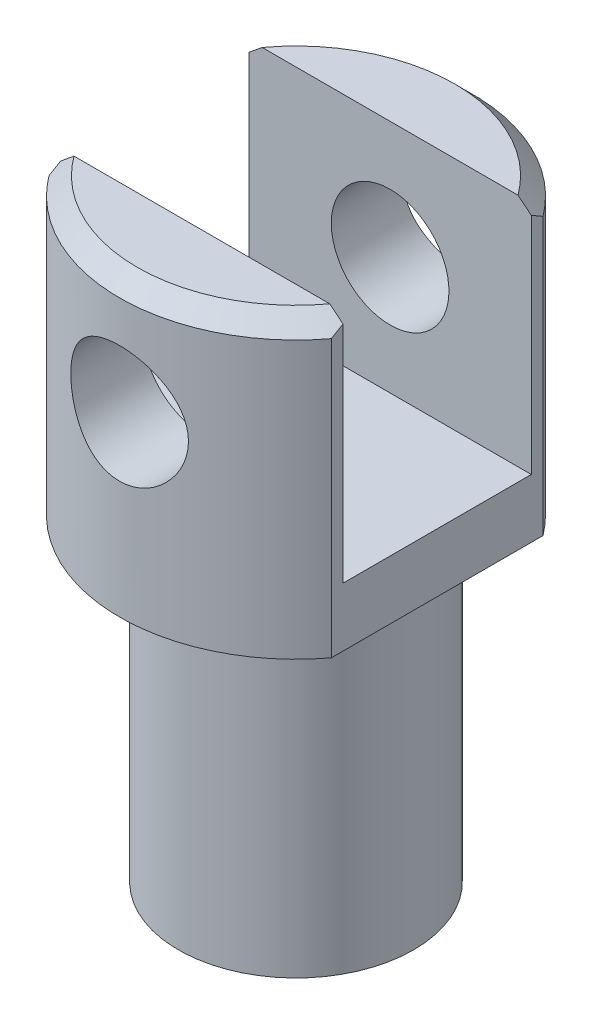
ISO-10303-21;
HEADER;
FILE_DESCRIPTION(('STEP AP214'),'2;1');
FILE_NAME('part.step','',(''),(''),'','','');
FILE_SCHEMA(('AUTOMOTIVE_DESIGN { 1 0 10303 214 1 1 1 1 }'));
ENDSEC;
DATA;
#1=APPLICATION_CONTEXT('core data for automotive mechanical design processes');
#2=APPLICATION_PROTOCOL_DEFINITION('international standard','automotive_design',2000,#1);
#3=PRODUCT_CONTEXT('',#1,'mechanical');
#4=PRODUCT('Part','Part','',(#3));
#5=PRODUCT_RELATED_PRODUCT_CATEGORY('part','',(#4));
#6=PRODUCT_DEFINITION_FORMATION('','',#4);
#7=PRODUCT_DEFINITION_CONTEXT('part definition',#1,'design');
#8=PRODUCT_DEFINITION('design','',#6,#7);
#9=PRODUCT_DEFINITION_SHAPE('','',#8);
#10=(LENGTH_UNIT() NAMED_UNIT(*) SI_UNIT(.MILLI.,.METRE.));
#11=(NAMED_UNIT(*) PLANE_ANGLE_UNIT() SI_UNIT($,.RADIAN.));
#12=(NAMED_UNIT(*) SI_UNIT($,.STERADIAN.) SOLID_ANGLE_UNIT());
#13=UNCERTAINTY_MEASURE_WITH_UNIT(LENGTH_MEASURE(1.E-05),#10,'distance_accuracy_value','');
#14=(GEOMETRIC_REPRESENTATION_CONTEXT(3) GLOBAL_UNCERTAINTY_ASSIGNED_CONTEXT((#13)) GLOBAL_UNIT_ASSIGNED_CONTEXT((#10,
#11,#12)) REPRESENTATION_CONTEXT('',''));
#15=CARTESIAN_POINT('',(0.,0.,0.));
#16=DIRECTION('',(0.,0.,1.));
#17=DIRECTION('',(1.,0.,0.));
#18=AXIS2_PLACEMENT_3D('',#15,#16,#17);
#19=CARTESIAN_POINT('',(0.,24.5,0.));
#20=DIRECTION('',(0.,-1.,0.));
#21=DIRECTION('',(1.,0.,0.));
#22=AXIS2_PLACEMENT_3D('',#19,#20,#21);
#23=CONICAL_SURFACE('',#22,15.,0.785398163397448);
#24=CARTESIAN_POINT('',(-12.,20.0499792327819,15.306969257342));
#25=CARTESIAN_POINT('',(-12.,20.2711295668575,15.0259350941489));
#26=CARTESIAN_POINT('',(-12.,20.4908772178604,14.7437881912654));
#27=CARTESIAN_POINT('',(-12.,20.9270976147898,14.1769416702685));
#28=CARTESIAN_POINT('',(-12.,21.1435701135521,13.8922418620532));
#29=CARTESIAN_POINT('',(-12.,21.5729780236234,13.3196834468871));
#30=CARTESIAN_POINT('',(-12.,21.785909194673,13.0318216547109));
#31=CARTESIAN_POINT('',(-12.,22.2073656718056,12.4528954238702));
#32=CARTESIAN_POINT('',(-12.,22.4158910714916,12.1618310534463));
#33=CARTESIAN_POINT('',(-12.,22.8250138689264,11.5800413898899));
#34=CARTESIAN_POINT('',(-12.,23.0256803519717,11.289364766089));
#35=CARTESIAN_POINT('',(-12.,23.4211336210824,10.7040415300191));
#36=CARTESIAN_POINT('',(-12.,23.6159205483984,10.4093950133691));
#37=CARTESIAN_POINT('',(-12.,23.9985332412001,9.81565161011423));
#38=CARTESIAN_POINT('',(-12.,24.1863598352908,9.51655525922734));
#39=CARTESIAN_POINT('',(-12.,24.5537465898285,8.91334325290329));
#40=CARTESIAN_POINT('',(-12.,24.7333071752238,8.60922785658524));
#41=CARTESIAN_POINT('',(-12.,25.1438065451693,7.88775435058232));
#42=CARTESIAN_POINT('',(-12.,25.3706938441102,7.46806596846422));
#43=CARTESIAN_POINT('',(-12.,25.8013110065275,6.61729217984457));
#44=CARTESIAN_POINT('',(-12.,26.00505824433,6.18621562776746));
#45=CARTESIAN_POINT('',(-12.,26.3848011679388,5.30724306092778));
#46=CARTESIAN_POINT('',(-12.,26.5605376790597,4.85923265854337));
#47=CARTESIAN_POINT('',(-12.,26.8741768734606,3.94893510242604));
#48=CARTESIAN_POINT('',(-12.,27.0119773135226,3.48661303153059));
#49=CARTESIAN_POINT('',(-12.,27.1263544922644,3.01779773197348));
#50=B_SPLINE_CURVE_WITH_KNOTS('',3,(#24,#25,#26,#27,#28,#29,#30,#31,#32,#33,#34,#35,#36,#37,#38,
#39,#40,#41,#42,#43,#44,#45,#46,#47,#48,#49),.UNSPECIFIED.,.F.,.F.,(4,2,2,2,2,2,2,2,2,2,2,2,4),
(0.,1.07284754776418,2.1457756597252,3.21990736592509,4.29401622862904,5.3535960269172,
6.41315034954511,7.47257812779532,8.53195138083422,9.96264180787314,11.3922508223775,
12.8344031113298,14.2804049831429),.UNSPECIFIED.);
#51=CARTESIAN_POINT('',(-12.,24.5,9.00000000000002));
#52=VERTEX_POINT('',#51);
#53=CARTESIAN_POINT('',(-12.,25.077794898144,8.));
#54=VERTEX_POINT('',#53);
#55=EDGE_CURVE('E166',#52,#54,#50,.T.);
#56=ORIENTED_EDGE('',*,*,#55,.F.);
#57=CARTESIAN_POINT('',(0.,24.5,0.));
#58=DIRECTION('',(0.,1.,0.));
#59=DIRECTION('',(-1.,0.,0.));
#60=AXIS2_PLACEMENT_3D('',#57,#58,#59);
#61=CIRCLE('',#60,15.);
#62=CARTESIAN_POINT('',(12.,24.5,9.00000000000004));
#63=VERTEX_POINT('',#62);
#64=EDGE_CURVE('E261',#52,#63,#61,.T.);
#65=ORIENTED_EDGE('',*,*,#64,.T.);
#66=CARTESIAN_POINT('',(12.,27.1263544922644,3.01779773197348));
#67=CARTESIAN_POINT('',(12.,27.0119773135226,3.48661303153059));
#68=CARTESIAN_POINT('',(12.,26.8741768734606,3.94893510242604));
#69=CARTESIAN_POINT('',(12.,26.5605376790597,4.85923265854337));
#70=CARTESIAN_POINT('',(12.,26.3848011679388,5.30724306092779));
#71=CARTESIAN_POINT('',(12.,26.00505824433,6.18621562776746));
#72=CARTESIAN_POINT('',(12.,25.8013110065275,6.61729217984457));
#73=CARTESIAN_POINT('',(12.,25.3706938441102,7.46806596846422));
#74=CARTESIAN_POINT('',(12.,25.1438065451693,7.88775435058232));
#75=CARTESIAN_POINT('',(12.,24.7333071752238,8.60922785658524));
#76=CARTESIAN_POINT('',(12.,24.5537465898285,8.9133432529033));
#77=CARTESIAN_POINT('',(12.,24.1863598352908,9.51655525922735));
#78=CARTESIAN_POINT('',(12.,23.9985332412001,9.81565161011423));
#79=CARTESIAN_POINT('',(12.,23.6159205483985,10.4093950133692));
#80=CARTESIAN_POINT('',(12.,23.4211336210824,10.7040415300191));
#81=CARTESIAN_POINT('',(12.,23.0256803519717,11.289364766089));
#82=CARTESIAN_POINT('',(12.,22.8250138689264,11.5800413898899));
#83=CARTESIAN_POINT('',(12.,22.4158910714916,12.1618310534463));
#84=CARTESIAN_POINT('',(12.,22.2073656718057,12.4528954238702));
#85=CARTESIAN_POINT('',(12.,21.785909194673,13.0318216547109));
#86=CARTESIAN_POINT('',(12.,21.5729780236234,13.3196834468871));
#87=CARTESIAN_POINT('',(12.,21.1435701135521,13.8922418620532));
#88=CARTESIAN_POINT('',(12.,20.9270976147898,14.1769416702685));
#89=CARTESIAN_POINT('',(12.,20.4908772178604,14.7437881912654));
#90=CARTESIAN_POINT('',(12.,20.2711295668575,15.0259350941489));
#91=CARTESIAN_POINT('',(12.,20.0499792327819,15.306969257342));
#92=B_SPLINE_CURVE_WITH_KNOTS('',3,(#66,#67,#68,#69,#70,#71,#72,#73,#74,#75,#76,#77,#78,#79,#80,
#81,#82,#83,#84,#85,#86,#87,#88,#89,#90,#91),.UNSPECIFIED.,.F.,.F.,(4,2,2,2,2,2,2,2,2,2,2,2,4),
(0.,1.44600187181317,2.88815416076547,4.31776317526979,5.74845360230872,6.80782685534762,
7.86725463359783,8.92680895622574,9.9863887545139,11.0604976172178,12.1346293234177,
13.2075574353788,14.2804049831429),.UNSPECIFIED.);
#93=CARTESIAN_POINT('',(12.,25.077794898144,8.));
#94=VERTEX_POINT('',#93);
#95=EDGE_CURVE('E215',#94,#63,#92,.T.);
#96=ORIENTED_EDGE('',*,*,#95,.F.);
#97=CARTESIAN_POINT('',(21.9010917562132,16.1835289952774,8.));
#98=CARTESIAN_POINT('',(21.4322837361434,16.623843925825,8.));
#99=CARTESIAN_POINT('',(20.9626766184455,17.0633122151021,8.));
#100=CARTESIAN_POINT('',(20.0214501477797,17.9401123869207,8.));
#101=CARTESIAN_POINT('',(19.5498307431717,18.3774442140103,8.));
#102=CARTESIAN_POINT('',(18.6039593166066,19.2497181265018,8.));
#103=CARTESIAN_POINT('',(18.1297061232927,19.6846589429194,8.));
#104=CARTESIAN_POINT('',(17.1782467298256,20.5512915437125,8.));
#105=CARTESIAN_POINT('',(16.7010405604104,20.9829833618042,8.));
#106=CARTESIAN_POINT('',(15.7462499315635,21.8393072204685,8.));
#107=CARTESIAN_POINT('',(15.2686907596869,22.2639674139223,8.));
#108=CARTESIAN_POINT('',(14.308993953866,23.1080764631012,8.));
#109=CARTESIAN_POINT('',(13.8268563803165,23.5275253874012,8.));
#110=CARTESIAN_POINT('',(12.8566638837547,24.3596114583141,8.));
#111=CARTESIAN_POINT('',(12.3686086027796,24.7722481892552,8.));
#112=CARTESIAN_POINT('',(11.6307432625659,25.3842129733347,8.));
#113=CARTESIAN_POINT('',(11.3838285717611,25.5870328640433,8.));
#114=CARTESIAN_POINT('',(10.8877620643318,25.9899157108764,8.));
#115=CARTESIAN_POINT('',(10.6386102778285,26.1899787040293,8.));
#116=CARTESIAN_POINT('',(10.1555457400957,26.5727042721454,8.));
#117=CARTESIAN_POINT('',(9.92181114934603,26.7555914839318,8.));
#118=CARTESIAN_POINT('',(9.45176517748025,27.1180188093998,8.));
#119=CARTESIAN_POINT('',(9.21545385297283,27.297558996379,8.));
#120=CARTESIAN_POINT('',(8.7399958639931,27.6525309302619,8.));
#121=CARTESIAN_POINT('',(8.50085111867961,27.8279652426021,8.));
#122=CARTESIAN_POINT('',(8.01910626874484,28.1740132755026,8.));
#123=CARTESIAN_POINT('',(7.77650631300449,28.344627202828,8.));
#124=CARTESIAN_POINT('',(7.28641570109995,28.6805777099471,8.));
#125=CARTESIAN_POINT('',(7.03891089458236,28.8458937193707,8.));
#126=CARTESIAN_POINT('',(6.53922204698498,29.1692142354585,8.));
#127=CARTESIAN_POINT('',(6.28703889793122,29.3272201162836,8.));
#128=CARTESIAN_POINT('',(5.77661874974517,29.6345205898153,8.));
#129=CARTESIAN_POINT('',(5.51836965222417,29.7837952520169,8.));
#130=CARTESIAN_POINT('',(5.12619639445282,29.9991596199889,8.));
#131=CARTESIAN_POINT('',(4.99462741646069,30.069545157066,8.));
#132=CARTESIAN_POINT('',(4.72979361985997,30.207090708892,8.));
#133=CARTESIAN_POINT('',(4.59652857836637,30.2742502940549,8.));
#134=CARTESIAN_POINT('',(4.46237149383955,30.3396092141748,8.));
#135=B_SPLINE_CURVE_WITH_KNOTS('',3,(#97,#98,#99,#100,#101,#102,#103,#104,#105,#106,#107,#108,
#109,#110,#111,#112,#113,#114,#115,#116,#117,#118,#119,#120,#121,#122,#123,#124,#125,#126,#127,
#128,#129,#130,#131,#132,#133,#134),.UNSPECIFIED.,.F.,.F.,(4,2,2,2,2,2,2,2,2,2,2,2,2,2,2,2,2,2,
4),(0.,1.92949116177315,3.85903214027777,5.78951380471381,7.71997540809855,9.63712859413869,
11.5542565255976,13.4715010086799,14.4300913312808,15.3886687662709,16.2789898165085,
17.1692913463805,18.0590208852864,18.948712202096,19.8415187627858,20.7341568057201,
21.6287587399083,22.0763579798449,22.5240166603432),.UNSPECIFIED.);
#136=CARTESIAN_POINT('',(10.8742815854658,26.,8.));
#137=VERTEX_POINT('',#136);
#138=EDGE_CURVE('E195',#94,#137,#135,.T.);
#139=ORIENTED_EDGE('',*,*,#138,.T.);
#140=CARTESIAN_POINT('',(0.,26.,0.));
#141=DIRECTION('',(0.,1.,0.));
#142=DIRECTION('',(-1.,0.,0.));
#143=AXIS2_PLACEMENT_3D('',#140,#141,#142);
#144=CIRCLE('',#143,13.5);
#145=CARTESIAN_POINT('',(-10.8742815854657,26.,8.));
#146=VERTEX_POINT('',#145);
#147=EDGE_CURVE('E264',#146,#137,#144,.T.);
#148=ORIENTED_EDGE('',*,*,#147,.F.);
#149=CARTESIAN_POINT('',(-4.46237149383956,30.3396092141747,8.));
#150=CARTESIAN_POINT('',(-4.59652857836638,30.2742502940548,8.));
#151=CARTESIAN_POINT('',(-4.72979361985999,30.207090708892,8.));
#152=CARTESIAN_POINT('',(-4.99462741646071,30.0695451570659,8.));
#153=CARTESIAN_POINT('',(-5.12619639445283,29.9991596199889,8.));
#154=CARTESIAN_POINT('',(-5.51836965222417,29.7837952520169,8.));
#155=CARTESIAN_POINT('',(-5.77661874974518,29.6345205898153,8.));
#156=CARTESIAN_POINT('',(-6.28703889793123,29.3272201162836,8.));
#157=CARTESIAN_POINT('',(-6.53922204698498,29.1692142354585,8.));
#158=CARTESIAN_POINT('',(-7.03891089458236,28.8458937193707,8.));
#159=CARTESIAN_POINT('',(-7.28641570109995,28.6805777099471,8.));
#160=CARTESIAN_POINT('',(-7.77650631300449,28.344627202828,8.));
#161=CARTESIAN_POINT('',(-8.01910626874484,28.1740132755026,8.));
#162=CARTESIAN_POINT('',(-8.5008511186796,27.8279652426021,8.));
#163=CARTESIAN_POINT('',(-8.73999586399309,27.6525309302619,8.));
#164=CARTESIAN_POINT('',(-9.21545385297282,27.297558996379,8.));
#165=CARTESIAN_POINT('',(-9.45176517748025,27.1180188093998,8.));
#166=CARTESIAN_POINT('',(-9.92181114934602,26.7555914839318,8.));
#167=CARTESIAN_POINT('',(-10.1555457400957,26.5727042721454,8.));
#168=CARTESIAN_POINT('',(-10.6386102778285,26.1899787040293,8.));
#169=CARTESIAN_POINT('',(-10.8877620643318,25.9899157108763,8.));
#170=CARTESIAN_POINT('',(-11.3838285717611,25.5870328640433,8.));
#171=CARTESIAN_POINT('',(-11.6307432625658,25.3842129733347,8.));
#172=CARTESIAN_POINT('',(-12.3686086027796,24.7722481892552,8.));
#173=CARTESIAN_POINT('',(-12.8566638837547,24.359611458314,8.));
#174=CARTESIAN_POINT('',(-13.8268563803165,23.5275253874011,8.));
#175=CARTESIAN_POINT('',(-14.308993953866,23.1080764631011,8.));
#176=CARTESIAN_POINT('',(-15.2686907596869,22.2639674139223,8.));
#177=CARTESIAN_POINT('',(-15.7462499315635,21.8393072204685,8.));
#178=CARTESIAN_POINT('',(-16.7010405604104,20.9829833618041,8.));
#179=CARTESIAN_POINT('',(-17.1782467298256,20.5512915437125,8.));
#180=CARTESIAN_POINT('',(-18.1297061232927,19.6846589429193,8.));
#181=CARTESIAN_POINT('',(-18.6039593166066,19.2497181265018,8.));
#182=CARTESIAN_POINT('',(-19.5498307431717,18.3774442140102,8.));
#183=CARTESIAN_POINT('',(-20.0214501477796,17.9401123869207,8.));
#184=CARTESIAN_POINT('',(-20.9626766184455,17.0633122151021,8.));
#185=CARTESIAN_POINT('',(-21.4322837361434,16.623843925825,8.));
#186=CARTESIAN_POINT('',(-21.9010917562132,16.1835289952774,8.));
#187=B_SPLINE_CURVE_WITH_KNOTS('',3,(#149,#150,#151,#152,#153,#154,#155,#156,#157,#158,#159,
#160,#161,#162,#163,#164,#165,#166,#167,#168,#169,#170,#171,#172,#173,#174,#175,#176,#177,#178,
#179,#180,#181,#182,#183,#184,#185,#186),.UNSPECIFIED.,.F.,.F.,(4,2,2,2,2,2,2,2,2,2,2,2,2,2,2,2,
2,2,4),(0.,0.447658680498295,0.895257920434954,1.78985985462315,2.6824978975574,
3.57530445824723,4.4649957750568,5.35472531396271,6.24502684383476,7.13534789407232,
8.09392532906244,9.05251565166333,10.9697601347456,12.8868880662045,14.8040412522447,
16.7345028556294,18.6649845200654,20.5945254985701,22.5240166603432),.UNSPECIFIED.);
#188=EDGE_CURVE('E202',#146,#54,#187,.T.);
#189=ORIENTED_EDGE('',*,*,#188,.T.);
#190=EDGE_LOOP('',(#56,#65,#96,#139,#148,#189));
#191=FACE_BOUND('',#190,.T.);
#192=ADVANCED_FACE('F33',(#191),#23,.T.);
#193=CARTESIAN_POINT('',(-12.,27.061932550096,-3.27192938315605));
#194=CARTESIAN_POINT('',(-12.,26.9944285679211,-3.52856686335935));
#195=CARTESIAN_POINT('',(-12.,26.9200222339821,-3.78329177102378));
#196=CARTESIAN_POINT('',(-12.,26.7589081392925,-4.28867001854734));
#197=CARTESIAN_POINT('',(-12.,26.672207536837,-4.53932563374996));
#198=CARTESIAN_POINT('',(-12.,26.3963374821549,-5.28377409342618));
#199=CARTESIAN_POINT('',(-12.,26.1909783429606,-5.7715848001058));
#200=CARTESIAN_POINT('',(-12.,25.7492549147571,-6.72765465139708));
#201=CARTESIAN_POINT('',(-12.,25.5131656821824,-7.19604364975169));
#202=CARTESIAN_POINT('',(-12.,25.0161845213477,-8.119892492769));
#203=CARTESIAN_POINT('',(-12.,24.7552714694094,-8.57534088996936));
#204=CARTESIAN_POINT('',(-12.,24.3030275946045,-9.32771611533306));
#205=CARTESIAN_POINT('',(-12.,24.1168461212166,-9.62777393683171));
#206=CARTESIAN_POINT('',(-12.,23.7372791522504,-10.2233094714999));
#207=CARTESIAN_POINT('',(-12.,23.5438934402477,-10.5187870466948));
#208=CARTESIAN_POINT('',(-12.,23.1510609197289,-11.1056429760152));
#209=CARTESIAN_POINT('',(-12.,22.9516145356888,-11.3970216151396));
#210=CARTESIAN_POINT('',(-12.,22.5475477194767,-11.9761709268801));
#211=CARTESIAN_POINT('',(-12.,22.3429271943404,-12.2639415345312));
#212=CARTESIAN_POINT('',(-12.,21.9267957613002,-12.8396866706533));
#213=CARTESIAN_POINT('',(-12.,21.7152318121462,-13.1276228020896));
#214=CARTESIAN_POINT('',(-12.,21.2881998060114,-13.7005887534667));
#215=CARTESIAN_POINT('',(-12.,21.072731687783,-13.9856185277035));
#216=CARTESIAN_POINT('',(-12.,20.6385711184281,-14.552898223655));
#217=CARTESIAN_POINT('',(-12.,20.4198809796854,-14.8351499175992));
#218=CARTESIAN_POINT('',(-12.,19.9795649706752,-15.3973288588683));
#219=CARTESIAN_POINT('',(-12.,19.7579392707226,-15.6772562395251));
#220=CARTESIAN_POINT('',(-12.,19.5350495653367,-15.9561663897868));
#221=B_SPLINE_CURVE_WITH_KNOTS('',3,(#193,#194,#195,#196,#197,#198,#199,#200,#201,#202,#203,
#204,#205,#206,#207,#208,#209,#210,#211,#212,#213,#214,#215,#216,#217,#218,#219,#220),
.UNSPECIFIED.,.F.,.F.,(4,2,2,2,2,2,2,2,2,2,2,2,2,4),(0.,0.795857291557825,1.59125308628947,
3.17728405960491,4.74998670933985,6.32403981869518,7.38332201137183,8.44263605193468,
9.5018760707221,10.5611351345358,11.6330109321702,12.7049035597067,13.776061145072,
14.8471568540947),.UNSPECIFIED.);
#222=CARTESIAN_POINT('',(-12.,25.077794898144,-7.99999999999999));
#223=VERTEX_POINT('',#222);
#224=CARTESIAN_POINT('',(-12.,24.5,-8.99999999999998));
#225=VERTEX_POINT('',#224);
#226=EDGE_CURVE('E160',#223,#225,#221,.T.);
#227=ORIENTED_EDGE('',*,*,#226,.F.);
#228=CARTESIAN_POINT('',(-21.9010917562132,16.1835289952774,-7.99999999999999));
#229=CARTESIAN_POINT('',(-21.4322837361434,16.623843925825,-7.99999999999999));
#230=CARTESIAN_POINT('',(-20.9626766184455,17.0633122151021,-7.99999999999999));
#231=CARTESIAN_POINT('',(-20.0214501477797,17.9401123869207,-7.99999999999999));
#232=CARTESIAN_POINT('',(-19.5498307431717,18.3774442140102,-7.99999999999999));
#233=CARTESIAN_POINT('',(-18.6039593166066,19.2497181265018,-7.99999999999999));
#234=CARTESIAN_POINT('',(-18.1297061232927,19.6846589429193,-7.99999999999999));
#235=CARTESIAN_POINT('',(-17.1782467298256,20.5512915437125,-7.99999999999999));
#236=CARTESIAN_POINT('',(-16.7010405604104,20.9829833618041,-7.99999999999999));
#237=CARTESIAN_POINT('',(-15.7462499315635,21.8393072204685,-7.99999999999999));
#238=CARTESIAN_POINT('',(-15.2686907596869,22.2639674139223,-7.99999999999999));
#239=CARTESIAN_POINT('',(-14.308993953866,23.1080764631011,-7.99999999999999));
#240=CARTESIAN_POINT('',(-13.8268563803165,23.5275253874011,-7.99999999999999));
#241=CARTESIAN_POINT('',(-12.8566638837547,24.359611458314,-7.99999999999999));
#242=CARTESIAN_POINT('',(-12.3686086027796,24.7722481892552,-7.99999999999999));
#243=CARTESIAN_POINT('',(-11.6307432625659,25.3842129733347,-7.99999999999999));
#244=CARTESIAN_POINT('',(-11.3838285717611,25.5870328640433,-7.99999999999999));
#245=CARTESIAN_POINT('',(-10.8877620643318,25.9899157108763,-7.99999999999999));
#246=CARTESIAN_POINT('',(-10.6386102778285,26.1899787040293,-7.99999999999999));
#247=CARTESIAN_POINT('',(-10.1555457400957,26.5727042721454,-7.99999999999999));
#248=CARTESIAN_POINT('',(-9.92181114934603,26.7555914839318,-7.99999999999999));
#249=CARTESIAN_POINT('',(-9.45176517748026,27.1180188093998,-7.99999999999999));
#250=CARTESIAN_POINT('',(-9.21545385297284,27.297558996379,-7.99999999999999));
#251=CARTESIAN_POINT('',(-8.73999586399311,27.6525309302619,-7.99999999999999));
#252=CARTESIAN_POINT('',(-8.50085111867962,27.8279652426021,-7.99999999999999));
#253=CARTESIAN_POINT('',(-8.01910626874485,28.1740132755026,-7.99999999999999));
#254=CARTESIAN_POINT('',(-7.7765063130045,28.344627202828,-7.99999999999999));
#255=CARTESIAN_POINT('',(-7.28641570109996,28.6805777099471,-7.99999999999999));
#256=CARTESIAN_POINT('',(-7.03891089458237,28.8458937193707,-7.99999999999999));
#257=CARTESIAN_POINT('',(-6.53922204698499,29.1692142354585,-7.99999999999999));
#258=CARTESIAN_POINT('',(-6.28703889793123,29.3272201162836,-7.99999999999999));
#259=CARTESIAN_POINT('',(-5.77661874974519,29.6345205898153,-7.99999999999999));
#260=CARTESIAN_POINT('',(-5.51836965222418,29.7837952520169,-7.99999999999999));
#261=CARTESIAN_POINT('',(-5.12619639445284,29.9991596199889,-7.99999999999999));
#262=CARTESIAN_POINT('',(-4.99462741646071,30.0695451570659,-7.99999999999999));
#263=CARTESIAN_POINT('',(-4.72979361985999,30.207090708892,-7.99999999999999));
#264=CARTESIAN_POINT('',(-4.59652857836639,30.2742502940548,-7.99999999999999));
#265=CARTESIAN_POINT('',(-4.46237149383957,30.3396092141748,-7.99999999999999));
#266=B_SPLINE_CURVE_WITH_KNOTS('',3,(#228,#229,#230,#231,#232,#233,#234,#235,#236,#237,#238,
#239,#240,#241,#242,#243,#244,#245,#246,#247,#248,#249,#250,#251,#252,#253,#254,#255,#256,#257,
#258,#259,#260,#261,#262,#263,#264,#265),.UNSPECIFIED.,.F.,.F.,(4,2,2,2,2,2,2,2,2,2,2,2,2,2,2,2,
2,2,4),(0.,1.92949116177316,3.85903214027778,5.78951380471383,7.71997540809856,9.63712859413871,
11.5542565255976,13.4715010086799,14.4300913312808,15.3886687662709,16.2789898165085,
17.1692913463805,18.0590208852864,18.948712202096,19.8415187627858,20.7341568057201,
21.6287587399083,22.0763579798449,22.5240166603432),.UNSPECIFIED.);
#267=CARTESIAN_POINT('',(-10.8742815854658,26.,-7.99999999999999));
#268=VERTEX_POINT('',#267);
#269=EDGE_CURVE('E189',#223,#268,#266,.T.);
#270=ORIENTED_EDGE('',*,*,#269,.T.);
#271=CARTESIAN_POINT('',(10.8742815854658,26.,-7.99999999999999));
#272=VERTEX_POINT('',#271);
#273=EDGE_CURVE('E263',#272,#268,#144,.T.);
#274=ORIENTED_EDGE('',*,*,#273,.F.);
#275=CARTESIAN_POINT('',(4.46237149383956,30.3396092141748,-7.99999999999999));
#276=CARTESIAN_POINT('',(4.59652857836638,30.2742502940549,-7.99999999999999));
#277=CARTESIAN_POINT('',(4.72979361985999,30.207090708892,-7.99999999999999));
#278=CARTESIAN_POINT('',(4.99462741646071,30.069545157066,-7.99999999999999));
#279=CARTESIAN_POINT('',(5.12619639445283,29.9991596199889,-7.99999999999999));
#280=CARTESIAN_POINT('',(5.51836965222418,29.7837952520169,-7.99999999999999));
#281=CARTESIAN_POINT('',(5.77661874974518,29.6345205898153,-7.99999999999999));
#282=CARTESIAN_POINT('',(6.28703889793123,29.3272201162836,-7.99999999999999));
#283=CARTESIAN_POINT('',(6.53922204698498,29.1692142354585,-7.99999999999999));
#284=CARTESIAN_POINT('',(7.03891089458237,28.8458937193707,-7.99999999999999));
#285=CARTESIAN_POINT('',(7.28641570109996,28.6805777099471,-7.99999999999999));
#286=CARTESIAN_POINT('',(7.7765063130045,28.344627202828,-7.99999999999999));
#287=CARTESIAN_POINT('',(8.01910626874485,28.1740132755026,-7.99999999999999));
#288=CARTESIAN_POINT('',(8.50085111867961,27.8279652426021,-7.99999999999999));
#289=CARTESIAN_POINT('',(8.7399958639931,27.6525309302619,-7.99999999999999));
#290=CARTESIAN_POINT('',(9.21545385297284,27.297558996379,-7.99999999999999));
#291=CARTESIAN_POINT('',(9.45176517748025,27.1180188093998,-7.99999999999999));
#292=CARTESIAN_POINT('',(9.92181114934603,26.7555914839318,-7.99999999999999));
#293=CARTESIAN_POINT('',(10.1555457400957,26.5727042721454,-7.99999999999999));
#294=CARTESIAN_POINT('',(10.6386102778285,26.1899787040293,-7.99999999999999));
#295=CARTESIAN_POINT('',(10.8877620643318,25.9899157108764,-7.99999999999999));
#296=CARTESIAN_POINT('',(11.3838285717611,25.5870328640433,-7.99999999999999));
#297=CARTESIAN_POINT('',(11.6307432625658,25.3842129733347,-7.99999999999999));
#298=CARTESIAN_POINT('',(12.3686086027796,24.7722481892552,-7.99999999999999));
#299=CARTESIAN_POINT('',(12.8566638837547,24.3596114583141,-7.99999999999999));
#300=CARTESIAN_POINT('',(13.8268563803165,23.5275253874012,-7.99999999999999));
#301=CARTESIAN_POINT('',(14.308993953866,23.1080764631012,-7.99999999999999));
#302=CARTESIAN_POINT('',(15.2686907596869,22.2639674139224,-7.99999999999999));
#303=CARTESIAN_POINT('',(15.7462499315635,21.8393072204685,-7.99999999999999));
#304=CARTESIAN_POINT('',(16.7010405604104,20.9829833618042,-7.99999999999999));
#305=CARTESIAN_POINT('',(17.1782467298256,20.5512915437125,-7.99999999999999));
#306=CARTESIAN_POINT('',(18.1297061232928,19.6846589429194,-7.99999999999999));
#307=CARTESIAN_POINT('',(18.6039593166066,19.2497181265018,-7.99999999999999));
#308=CARTESIAN_POINT('',(19.5498307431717,18.3774442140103,-7.99999999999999));
#309=CARTESIAN_POINT('',(20.0214501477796,17.9401123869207,-7.99999999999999));
#310=CARTESIAN_POINT('',(20.9626766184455,17.0633122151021,-7.99999999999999));
#311=CARTESIAN_POINT('',(21.4322837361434,16.623843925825,-7.99999999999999));
#312=CARTESIAN_POINT('',(21.9010917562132,16.1835289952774,-7.99999999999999));
#313=B_SPLINE_CURVE_WITH_KNOTS('',3,(#275,#276,#277,#278,#279,#280,#281,#282,#283,#284,#285,
#286,#287,#288,#289,#290,#291,#292,#293,#294,#295,#296,#297,#298,#299,#300,#301,#302,#303,#304,
#305,#306,#307,#308,#309,#310,#311,#312),.UNSPECIFIED.,.F.,.F.,(4,2,2,2,2,2,2,2,2,2,2,2,2,2,2,2,
2,2,4),(0.,0.447658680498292,0.895257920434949,1.78985985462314,2.68249789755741,
3.57530445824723,4.46499577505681,5.35472531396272,6.24502684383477,7.13534789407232,
8.09392532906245,9.05251565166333,10.9697601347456,12.8868880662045,14.8040412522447,
16.7345028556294,18.6649845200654,20.5945254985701,22.5240166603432),.UNSPECIFIED.);
#314=CARTESIAN_POINT('',(12.,25.077794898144,-7.99999999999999));
#315=VERTEX_POINT('',#314);
#316=EDGE_CURVE('E180',#272,#315,#313,.T.);
#317=ORIENTED_EDGE('',*,*,#316,.T.);
#318=CARTESIAN_POINT('',(12.,19.5350495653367,-15.9561663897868));
#319=CARTESIAN_POINT('',(12.,19.7579392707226,-15.6772562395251));
#320=CARTESIAN_POINT('',(12.,19.9795649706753,-15.3973288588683));
#321=CARTESIAN_POINT('',(12.,20.4198809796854,-14.8351499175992));
#322=CARTESIAN_POINT('',(12.,20.6385711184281,-14.552898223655));
#323=CARTESIAN_POINT('',(12.,21.0727316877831,-13.9856185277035));
#324=CARTESIAN_POINT('',(12.,21.2881998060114,-13.7005887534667));
#325=CARTESIAN_POINT('',(12.,21.7152318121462,-13.1276228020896));
#326=CARTESIAN_POINT('',(12.,21.9267957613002,-12.8396866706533));
#327=CARTESIAN_POINT('',(12.,22.3429271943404,-12.2639415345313));
#328=CARTESIAN_POINT('',(12.,22.5475477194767,-11.9761709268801));
#329=CARTESIAN_POINT('',(12.,22.9516145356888,-11.3970216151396));
#330=CARTESIAN_POINT('',(12.,23.1510609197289,-11.1056429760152));
#331=CARTESIAN_POINT('',(12.,23.5438934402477,-10.5187870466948));
#332=CARTESIAN_POINT('',(12.,23.7372791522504,-10.2233094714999));
#333=CARTESIAN_POINT('',(12.,24.1168461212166,-9.62777393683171));
#334=CARTESIAN_POINT('',(12.,24.3030275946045,-9.32771611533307));
#335=CARTESIAN_POINT('',(12.,24.7552714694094,-8.57534088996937));
#336=CARTESIAN_POINT('',(12.,25.0161845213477,-8.11989249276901));
#337=CARTESIAN_POINT('',(12.,25.5131656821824,-7.1960436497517));
#338=CARTESIAN_POINT('',(12.,25.7492549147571,-6.72765465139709));
#339=CARTESIAN_POINT('',(12.,26.1909783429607,-5.7715848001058));
#340=CARTESIAN_POINT('',(12.,26.3963374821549,-5.28377409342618));
#341=CARTESIAN_POINT('',(12.,26.672207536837,-4.53932563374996));
#342=CARTESIAN_POINT('',(12.,26.7589081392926,-4.28867001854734));
#343=CARTESIAN_POINT('',(12.,26.9200222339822,-3.78329177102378));
#344=CARTESIAN_POINT('',(12.,26.9944285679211,-3.52856686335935));
#345=CARTESIAN_POINT('',(12.,27.0619325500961,-3.27192938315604));
#346=B_SPLINE_CURVE_WITH_KNOTS('',3,(#318,#319,#320,#321,#322,#323,#324,#325,#326,#327,#328,
#329,#330,#331,#332,#333,#334,#335,#336,#337,#338,#339,#340,#341,#342,#343,#344,#345),
.UNSPECIFIED.,.F.,.F.,(4,2,2,2,2,2,2,2,2,2,2,2,2,4),(0.,1.07109570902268,2.14225329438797,
3.21414592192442,4.28602171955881,5.34528078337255,6.40452080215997,7.46383484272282,
8.52311703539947,10.0971701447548,11.6698727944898,13.2559037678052,14.0512995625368,
14.8471568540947),.UNSPECIFIED.);
#347=CARTESIAN_POINT('',(12.,24.5,-9.));
#348=VERTEX_POINT('',#347);
#349=EDGE_CURVE('E209',#348,#315,#346,.T.);
#350=ORIENTED_EDGE('',*,*,#349,.F.);
#351=EDGE_CURVE('E260',#348,#225,#61,.T.);
#352=ORIENTED_EDGE('',*,*,#351,.T.);
#353=EDGE_LOOP('',(#227,#270,#274,#317,#350,#352));
#354=FACE_BOUND('',#353,.T.);
#355=ADVANCED_FACE('F175',(#354),#23,.T.);
#356=CARTESIAN_POINT('',(0.,40.,0.));
#357=DIRECTION('',(0.,1.,0.));
#358=DIRECTION('',(-1.,0.,0.));
#359=AXIS2_PLACEMENT_3D('',#356,#357,#358);
#360=CYLINDRICAL_SURFACE('',#359,15.);
#361=CARTESIAN_POINT('',(5.00000000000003,16.,14.1421356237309));
#362=CARTESIAN_POINT('',(5.00000128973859,15.7276591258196,14.1421347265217));
#363=CARTESIAN_POINT('',(4.97767391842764,15.455326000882,14.1500884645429));
#364=CARTESIAN_POINT('',(4.88925565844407,14.9187278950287,14.1808787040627));
#365=CARTESIAN_POINT('',(4.82315756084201,14.6544642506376,14.2037176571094));
#366=CARTESIAN_POINT('',(4.64977742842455,14.1418655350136,14.2614101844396));
#367=CARTESIAN_POINT('',(4.54257610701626,13.8935003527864,14.2962401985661));
#368=CARTESIAN_POINT('',(4.29030814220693,13.4181997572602,14.3739561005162));
#369=CARTESIAN_POINT('',(4.14523314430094,13.1912690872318,14.4168437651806));
#370=CARTESIAN_POINT('',(3.81525573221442,12.7564001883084,14.5077244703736));
#371=CARTESIAN_POINT('',(3.62912170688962,12.5494228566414,14.5558447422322));
#372=CARTESIAN_POINT('',(3.224938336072,12.1689659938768,14.6506932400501));
#373=CARTESIAN_POINT('',(3.00688387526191,11.9954918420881,14.6974212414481));
#374=CARTESIAN_POINT('',(2.53802253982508,11.682605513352,14.7856933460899));
#375=CARTESIAN_POINT('',(2.28650955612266,11.5442001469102,14.8270703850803));
#376=CARTESIAN_POINT('',(1.7621561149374,11.3120420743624,14.8984793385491));
#377=CARTESIAN_POINT('',(1.48932142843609,11.2182773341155,14.9285143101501));
#378=CARTESIAN_POINT('',(0.940144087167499,11.081320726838,14.9729537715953));
#379=CARTESIAN_POINT('',(0.664253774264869,11.036482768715,14.987865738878));
#380=CARTESIAN_POINT('',(0.108489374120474,10.9934185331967,15.0021804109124));
#381=CARTESIAN_POINT('',(-0.171383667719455,10.9951802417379,15.0015871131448));
#382=CARTESIAN_POINT('',(-0.715517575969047,11.0442212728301,14.9853019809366));
#383=CARTESIAN_POINT('',(-0.979960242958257,11.0897126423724,14.9702032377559));
#384=CARTESIAN_POINT('',(-1.49721719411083,11.2219649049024,14.9273483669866));
#385=CARTESIAN_POINT('',(-1.75003068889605,11.3087285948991,14.8995913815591));
#386=CARTESIAN_POINT('',(-2.24076237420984,11.5221065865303,14.8337835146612));
#387=CARTESIAN_POINT('',(-2.4784411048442,11.6492296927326,14.7956021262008));
#388=CARTESIAN_POINT('',(-2.92962162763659,11.9392985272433,14.7129196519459));
#389=CARTESIAN_POINT('',(-3.14311667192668,12.1022542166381,14.6684168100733));
#390=CARTESIAN_POINT('',(-3.55050433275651,12.4683719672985,14.5753095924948));
#391=CARTESIAN_POINT('',(-3.74300078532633,12.6730657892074,14.5266107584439));
#392=CARTESIAN_POINT('',(-4.09138629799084,13.1122436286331,14.432366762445));
#393=CARTESIAN_POINT('',(-4.24726971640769,13.3467322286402,14.3868220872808));
#394=CARTESIAN_POINT('',(-4.51993727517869,13.8432681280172,14.3035262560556));
#395=CARTESIAN_POINT('',(-4.63613231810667,14.1056606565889,14.2658954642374));
#396=CARTESIAN_POINT('',(-4.82221596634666,14.6478569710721,14.2040825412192));
#397=CARTESIAN_POINT('',(-4.89212397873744,14.9276534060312,14.1798947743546));
#398=CARTESIAN_POINT('',(-4.98080641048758,15.4831917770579,14.1489818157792));
#399=CARTESIAN_POINT('',(-5.00174547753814,15.7585471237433,14.1415180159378));
#400=CARTESIAN_POINT('',(-4.99802719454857,16.3088807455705,14.1428336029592));
#401=CARTESIAN_POINT('',(-4.97337812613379,16.5838590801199,14.1516100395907));
#402=CARTESIAN_POINT('',(-4.88112825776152,17.1157848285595,14.183680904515));
#403=CARTESIAN_POINT('',(-4.81503196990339,17.3730271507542,14.206466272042));
#404=CARTESIAN_POINT('',(-4.64356931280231,17.8727180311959,14.2634276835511));
#405=CARTESIAN_POINT('',(-4.53819598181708,18.1151639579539,14.297605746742));
#406=CARTESIAN_POINT('',(-4.28737170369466,18.586902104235,14.3748438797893));
#407=CARTESIAN_POINT('',(-4.14075559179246,18.815533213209,14.4181512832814));
#408=CARTESIAN_POINT('',(-3.81292815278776,19.2457302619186,14.5082884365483));
#409=CARTESIAN_POINT('',(-3.63170662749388,19.4472881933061,14.5551192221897));
#410=CARTESIAN_POINT('',(-3.2294585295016,19.8276399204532,14.6497519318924));
#411=CARTESIAN_POINT('',(-3.00693635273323,20.0048719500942,14.6974921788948));
#412=CARTESIAN_POINT('',(-2.53413645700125,20.3195807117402,14.7863425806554));
#413=CARTESIAN_POINT('',(-2.28385972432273,20.4570588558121,14.8274529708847));
#414=CARTESIAN_POINT('',(-1.76389931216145,20.6871005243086,14.8982202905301));
#415=CARTESIAN_POINT('',(-1.49435561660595,20.7799563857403,14.9279515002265));
#416=CARTESIAN_POINT('',(-0.942292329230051,20.9186387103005,14.9729305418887));
#417=CARTESIAN_POINT('',(-0.659777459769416,20.9644821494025,14.9881836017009));
#418=CARTESIAN_POINT('',(-0.104076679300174,21.0063103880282,15.0020931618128));
#419=CARTESIAN_POINT('',(0.168923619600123,21.0045372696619,15.0014960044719));
#420=CARTESIAN_POINT('',(0.710555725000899,20.956713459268,14.9856098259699));
#421=CARTESIAN_POINT('',(0.979187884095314,20.9106663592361,14.9703219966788));
#422=CARTESIAN_POINT('',(1.50021059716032,20.7770888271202,14.9270457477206));
#423=CARTESIAN_POINT('',(1.75279135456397,20.6902289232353,14.8992629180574));
#424=CARTESIAN_POINT('',(2.23989175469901,20.4781123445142,14.8338580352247));
#425=CARTESIAN_POINT('',(2.47440812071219,20.3528487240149,14.7962342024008));
#426=CARTESIAN_POINT('',(2.92817008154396,20.06215243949,14.713293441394));
#427=CARTESIAN_POINT('',(3.14653125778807,19.8954065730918,14.6677436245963));
#428=CARTESIAN_POINT('',(3.55290513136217,19.528713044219,14.574649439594));
#429=CARTESIAN_POINT('',(3.74090810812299,19.3287547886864,14.5271044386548));
#430=CARTESIAN_POINT('',(4.08870904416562,18.8919532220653,14.4331639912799));
#431=CARTESIAN_POINT('',(4.24711482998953,18.6539724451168,14.3868863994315));
#432=CARTESIAN_POINT('',(4.5215717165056,18.1533278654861,14.3030096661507));
#433=CARTESIAN_POINT('',(4.6376338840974,17.8906705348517,14.2654082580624));
#434=CARTESIAN_POINT('',(4.81921914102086,17.3601908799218,14.2050667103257));
#435=CARTESIAN_POINT('',(4.88678954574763,17.0931386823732,14.1817316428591));
#436=CARTESIAN_POINT('',(4.97717160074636,16.5507197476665,14.1502691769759));
#437=CARTESIAN_POINT('',(4.99999869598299,16.2753559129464,14.142136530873));
#438=CARTESIAN_POINT('',(5.00000000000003,16.,14.1421356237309));
#439=B_SPLINE_CURVE_WITH_KNOTS('',3,(#361,#362,#363,#364,#365,#366,#367,#368,#369,#370,#371,
#372,#373,#374,#375,#376,#377,#378,#379,#380,#381,#382,#383,#384,#385,#386,#387,#388,#389,#390,
#391,#392,#393,#394,#395,#396,#397,#398,#399,#400,#401,#402,#403,#404,#405,#406,#407,#408,#409,
#410,#411,#412,#413,#414,#415,#416,#417,#418,#419,#420,#421,#422,#423,#424,#425,#426,#427,#428,
#429,#430,#431,#432,#433,#434,#435,#436,#437,#438),.UNSPECIFIED.,.T.,.F.,(4,2,2,2,2,2,2,2,2,2,2,
2,2,2,2,2,2,2,2,2,2,2,2,2,2,2,2,2,2,2,2,2,2,2,2,2,2,2,4),(0.,0.816002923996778,1.63214027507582,
2.44668313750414,3.26140583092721,4.10506687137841,4.9488632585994,5.81467530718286,
6.68025381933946,7.51571593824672,8.35096266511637,9.15345024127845,9.95599220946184,
10.7690827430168,11.5823995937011,12.4340087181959,13.2857489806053,14.1496319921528,
15.0131525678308,15.837714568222,16.6621267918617,17.4582197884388,18.2544539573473,
19.0759428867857,19.8976742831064,20.7589404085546,21.6201759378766,22.4756895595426,
23.3308941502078,24.1459042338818,24.9608482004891,25.7628478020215,26.5649925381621,
27.3967759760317,28.2288252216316,29.0934451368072,29.9578389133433,30.7831606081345,
31.6081973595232),.UNSPECIFIED.);
#440=CARTESIAN_POINT('',(5.00000000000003,16.,14.1421356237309));
#441=VERTEX_POINT('',#440);
#442=EDGE_CURVE('E136',#441,#441,#439,.T.);
#443=ORIENTED_EDGE('',*,*,#442,.T.);
#444=EDGE_LOOP('',(#443));
#445=FACE_BOUND('',#444,.T.);
#446=DIRECTION('',(0.,1.,0.));
#447=VECTOR('',#446,1.);
#448=CARTESIAN_POINT('',(-12.,40.,8.99999999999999));
#449=LINE('',#448,#447);
#450=CARTESIAN_POINT('',(-12.,0.999999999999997,8.99999999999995));
#451=VERTEX_POINT('',#450);
#452=EDGE_CURVE('E289',#451,#52,#449,.T.);
#453=ORIENTED_EDGE('',*,*,#452,.F.);
#454=CARTESIAN_POINT('',(0.,0.999999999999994,0.));
#455=DIRECTION('',(0.,1.,0.));
#456=DIRECTION('',(-1.,0.,0.));
#457=AXIS2_PLACEMENT_3D('',#454,#455,#456);
#458=CIRCLE('',#457,15.);
#459=CARTESIAN_POINT('',(12.,0.999999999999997,8.99999999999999));
#460=VERTEX_POINT('',#459);
#461=EDGE_CURVE('E254',#451,#460,#458,.T.);
#462=ORIENTED_EDGE('',*,*,#461,.T.);
#463=DIRECTION('',(0.,1.,0.));
#464=VECTOR('',#463,1.);
#465=CARTESIAN_POINT('',(12.,40.,8.99999999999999));
#466=LINE('',#465,#464);
#467=EDGE_CURVE('E221',#63,#460,#466,.F.);
#468=ORIENTED_EDGE('',*,*,#467,.F.);
#469=ORIENTED_EDGE('',*,*,#64,.F.);
#470=EDGE_LOOP('',(#453,#462,#468,#469));
#471=FACE_BOUND('',#470,.T.);
#472=ADVANCED_FACE('F140',(#445,#471),#360,.T.);
#473=CARTESIAN_POINT('',(0.,21.,-15.));
#474=CARTESIAN_POINT('',(-0.2728168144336,21.0000012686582,-15.0000007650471));
#475=CARTESIAN_POINT('',(-0.545625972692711,20.9775986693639,-14.9924884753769));
#476=CARTESIAN_POINT('',(-1.08320880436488,20.8888544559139,-14.9632605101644));
#477=CARTESIAN_POINT('',(-1.34798164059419,20.8225082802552,-14.941543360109));
#478=CARTESIAN_POINT('',(-1.86166394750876,20.6484037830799,-14.8862653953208));
#479=CARTESIAN_POINT('',(-2.11059912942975,20.5407146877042,-14.8527243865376));
#480=CARTESIAN_POINT('',(-2.58687468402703,20.2872941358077,-14.7772222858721));
#481=CARTESIAN_POINT('',(-2.81421078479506,20.1415551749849,-14.7352595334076));
#482=CARTESIAN_POINT('',(-3.24870837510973,19.8108709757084,-14.6457047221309));
#483=CARTESIAN_POINT('',(-3.4550185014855,19.6248438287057,-14.5979778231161));
#484=CARTESIAN_POINT('',(-3.83416346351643,19.221164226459,-14.5030157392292));
#485=CARTESIAN_POINT('',(-4.00699092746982,19.0035048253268,-14.4557806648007));
#486=CARTESIAN_POINT('',(-4.31912471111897,18.5350744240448,-14.3656666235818));
#487=CARTESIAN_POINT('',(-4.4573242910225,18.2835313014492,-14.3229519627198));
#488=CARTESIAN_POINT('',(-4.68909436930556,17.7591195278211,-14.2487652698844));
#489=CARTESIAN_POINT('',(-4.78267848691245,17.4862574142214,-14.2172898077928));
#490=CARTESIAN_POINT('',(-4.91936730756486,16.9366338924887,-14.1705651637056));
#491=CARTESIAN_POINT('',(-4.96406724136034,16.6603139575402,-14.1548047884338));
#492=CARTESIAN_POINT('',(-5.00670561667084,16.103681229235,-14.1397828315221));
#493=CARTESIAN_POINT('',(-5.00465850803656,15.8233696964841,-14.1405161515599));
#494=CARTESIAN_POINT('',(-4.95509951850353,15.2803168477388,-14.1579507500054));
#495=CARTESIAN_POINT('',(-4.90966956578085,15.0173579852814,-14.1739207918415));
#496=CARTESIAN_POINT('',(-4.77803081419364,14.5030329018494,-14.2188328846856));
#497=CARTESIAN_POINT('',(-4.69181713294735,14.2516680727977,-14.2477764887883));
#498=CARTESIAN_POINT('',(-4.47969529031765,13.7629362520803,-14.3158955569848));
#499=CARTESIAN_POINT('',(-4.35317024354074,13.5258598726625,-14.3552282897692));
#500=CARTESIAN_POINT('',(-4.06444553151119,13.0756454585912,-14.4396279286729));
#501=CARTESIAN_POINT('',(-3.90223556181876,12.8625143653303,-14.4846964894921));
#502=CARTESIAN_POINT('',(-3.53674666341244,12.454542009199,-14.5783664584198));
#503=CARTESIAN_POINT('',(-3.33176575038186,12.2612365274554,-14.6270294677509));
#504=CARTESIAN_POINT('',(-2.89169784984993,11.9113436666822,-14.7203469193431));
#505=CARTESIAN_POINT('',(-2.65660797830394,11.7547598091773,-14.765000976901));
#506=CARTESIAN_POINT('',(-2.15973806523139,11.4815184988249,-14.8458553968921));
#507=CARTESIAN_POINT('',(-1.89771638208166,11.3652725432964,-14.8819675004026));
#508=CARTESIAN_POINT('',(-1.35634541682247,11.1789841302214,-14.9410283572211));
#509=CARTESIAN_POINT('',(-1.07700219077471,11.1089256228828,-14.9639816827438));
#510=CARTESIAN_POINT('',(-0.521919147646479,11.0197216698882,-14.9933813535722));
#511=CARTESIAN_POINT('',(-0.246547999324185,10.9985009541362,-15.0005000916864));
#512=CARTESIAN_POINT('',(0.303875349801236,11.0016633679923,-14.9994451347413));
#513=CARTESIAN_POINT('',(0.578927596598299,11.0260387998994,-14.9912740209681));
#514=CARTESIAN_POINT('',(1.11259933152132,11.1180595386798,-14.9610012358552));
#515=CARTESIAN_POINT('',(1.37146403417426,11.1844310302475,-14.9393099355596));
#516=CARTESIAN_POINT('',(1.87427979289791,11.3569672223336,-14.8845923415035));
#517=CARTESIAN_POINT('',(2.11822894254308,11.4631369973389,-14.8515646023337));
#518=CARTESIAN_POINT('',(2.59144148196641,11.7153521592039,-14.7764465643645));
#519=CARTESIAN_POINT('',(2.82014979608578,11.8623729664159,-14.7341407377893));
#520=CARTESIAN_POINT('',(3.25032415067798,12.1909707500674,-14.6452626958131));
#521=CARTESIAN_POINT('',(3.45178183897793,12.3725582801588,-14.5986891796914));
#522=CARTESIAN_POINT('',(3.83126253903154,12.7748937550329,-14.5038423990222));
#523=CARTESIAN_POINT('',(4.00780484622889,12.9970461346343,-14.4555880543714));
#524=CARTESIAN_POINT('',(4.32128761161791,13.4688578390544,-14.3649986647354));
#525=CARTESIAN_POINT('',(4.4582277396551,13.7185173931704,-14.3226636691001));
#526=CARTESIAN_POINT('',(4.68798465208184,14.2383650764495,-14.2491195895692));
#527=CARTESIAN_POINT('',(4.78089066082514,14.5085103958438,-14.2178880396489));
#528=CARTESIAN_POINT('',(4.91947333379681,15.0618932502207,-14.1705416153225));
#529=CARTESIAN_POINT('',(4.96517127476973,15.3451248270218,-14.154419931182));
#530=CARTESIAN_POINT('',(5.00638141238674,15.9009854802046,-14.1398929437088));
#531=CARTESIAN_POINT('',(5.00435128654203,16.1734117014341,-14.1406200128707));
#532=CARTESIAN_POINT('',(4.95621146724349,16.7138253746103,-14.1575634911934));
#533=CARTESIAN_POINT('',(4.91010439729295,16.9818130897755,-14.1737789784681));
#534=CARTESIAN_POINT('',(4.77685906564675,17.5006783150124,-14.2192262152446));
#535=CARTESIAN_POINT('',(4.69051673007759,17.7517841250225,-14.2482049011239));
#536=CARTESIAN_POINT('',(4.47989682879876,18.2361370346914,-14.3158199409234));
#537=CARTESIAN_POINT('',(4.35561084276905,18.46938015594,-14.3544584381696));
#538=CARTESIAN_POINT('',(4.06630346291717,18.9224183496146,-14.4391414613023));
#539=CARTESIAN_POINT('',(3.89974121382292,19.1411825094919,-14.4854355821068));
#540=CARTESIAN_POINT('',(3.53321441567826,19.548449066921,-14.5791678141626));
#541=CARTESIAN_POINT('',(3.33324042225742,19.7369428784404,-14.6266062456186));
#542=CARTESIAN_POINT('',(2.89620778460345,20.0857220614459,-14.7195015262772));
#543=CARTESIAN_POINT('',(2.65800756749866,20.244621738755,-14.7648090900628));
#544=CARTESIAN_POINT('',(2.15678678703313,20.5199521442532,-14.8462995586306));
#545=CARTESIAN_POINT('',(1.89377259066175,20.6363937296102,-14.8824847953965));
#546=CARTESIAN_POINT('',(1.36246823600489,20.8186081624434,-14.9402757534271));
#547=CARTESIAN_POINT('',(1.09493878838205,20.8864123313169,-14.9624606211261));
#548=CARTESIAN_POINT('',(0.551602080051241,20.9771014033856,-14.9923203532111));
#549=CARTESIAN_POINT('',(0.275797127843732,20.9999987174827,-14.9999992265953));
#550=CARTESIAN_POINT('',(0.,21.,-15.));
#551=B_SPLINE_CURVE_WITH_KNOTS('',3,(#473,#474,#475,#476,#477,#478,#479,#480,#481,#482,#483,
#484,#485,#486,#487,#488,#489,#490,#491,#492,#493,#494,#495,#496,#497,#498,#499,#500,#501,#502,
#503,#504,#505,#506,#507,#508,#509,#510,#511,#512,#513,#514,#515,#516,#517,#518,#519,#520,#521,
#522,#523,#524,#525,#526,#527,#528,#529,#530,#531,#532,#533,#534,#535,#536,#537,#538,#539,#540,
#541,#542,#543,#544,#545,#546,#547,#548,#549,#550),.UNSPECIFIED.,.T.,.F.,(4,2,2,2,2,2,2,2,2,2,2,
2,2,2,2,2,2,2,2,2,2,2,2,2,2,2,2,2,2,2,2,2,2,2,2,2,2,2,4),(0.,0.817435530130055,1.6349559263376,
2.45111336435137,3.2674318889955,4.1092342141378,4.95122166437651,5.8174192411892,
6.68335223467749,7.52009628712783,8.3565816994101,9.15484132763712,9.9531965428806,
10.764408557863,11.5758551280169,12.4296652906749,13.2835572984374,14.1459202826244,
15.0079834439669,15.832679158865,16.6572356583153,17.4579078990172,18.2586822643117,
19.0805199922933,19.9026090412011,20.7620511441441,21.6215004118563,22.479200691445,
23.3365142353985,24.1497833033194,24.9630039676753,25.7607793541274,26.5587319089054,
27.3915033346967,28.2245105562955,29.0899830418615,29.9552340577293,30.7818279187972,
31.6081933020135),.UNSPECIFIED.);
#552=CARTESIAN_POINT('',(0.,21.,-15.));
#553=VERTEX_POINT('',#552);
#554=EDGE_CURVE('E129',#553,#553,#551,.T.);
#555=ORIENTED_EDGE('',*,*,#554,.T.);
#556=EDGE_LOOP('',(#555));
#557=FACE_BOUND('',#556,.T.);
#558=DIRECTION('',(0.,1.,0.));
#559=VECTOR('',#558,1.);
#560=CARTESIAN_POINT('',(-12.,40.,-8.99999999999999));
#561=LINE('',#560,#559);
#562=CARTESIAN_POINT('',(-12.,1.,-8.99999999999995));
#563=VERTEX_POINT('',#562);
#564=EDGE_CURVE('E171',#225,#563,#561,.F.);
#565=ORIENTED_EDGE('',*,*,#564,.F.);
#566=ORIENTED_EDGE('',*,*,#351,.F.);
#567=DIRECTION('',(0.,1.,0.));
#568=VECTOR('',#567,1.);
#569=CARTESIAN_POINT('',(12.,40.,-8.99999999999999));
#570=LINE('',#569,#568);
#571=CARTESIAN_POINT('',(12.,1.,-8.99999999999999));
#572=VERTEX_POINT('',#571);
#573=EDGE_CURVE('E224',#572,#348,#570,.T.);
#574=ORIENTED_EDGE('',*,*,#573,.F.);
#575=EDGE_CURVE('E257',#572,#563,#458,.T.);
#576=ORIENTED_EDGE('',*,*,#575,.T.);
#577=EDGE_LOOP('',(#565,#566,#574,#576));
#578=FACE_BOUND('',#577,.T.);
#579=ADVANCED_FACE('F286',(#557,#578),#360,.T.);
#580=CARTESIAN_POINT('',(15.,1.,0.));
#581=DIRECTION('',(0.,1.,0.));
#582=DIRECTION('',(-1.,0.,0.));
#583=AXIS2_PLACEMENT_3D('',#580,#581,#582);
#584=PLANE('',#583);
#585=CARTESIAN_POINT('',(0.,0.999999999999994,0.));
#586=DIRECTION('',(0.,1.,0.));
#587=DIRECTION('',(-1.,0.,0.));
#588=AXIS2_PLACEMENT_3D('',#585,#586,#587);
#589=CIRCLE('',#588,9.99999999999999);
#590=CARTESIAN_POINT('',(-9.99999999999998,0.999999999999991,0.));
#591=VERTEX_POINT('',#590);
#592=EDGE_CURVE('E250',#591,#591,#589,.T.);
#593=ORIENTED_EDGE('',*,*,#592,.T.);
#594=EDGE_LOOP('',(#593));
#595=FACE_BOUND('',#594,.T.);
#596=DIRECTION('',(0.,0.,-1.));
#597=VECTOR('',#596,1.);
#598=CARTESIAN_POINT('',(-12.,1.,-12.));
#599=LINE('',#598,#597);
#600=EDGE_CURVE('E274',#451,#563,#599,.T.);
#601=ORIENTED_EDGE('',*,*,#600,.T.);
#602=ORIENTED_EDGE('',*,*,#575,.F.);
#603=DIRECTION('',(0.,0.,-1.));
#604=VECTOR('',#603,1.);
#605=CARTESIAN_POINT('',(12.,1.,-12.));
#606=LINE('',#605,#604);
#607=EDGE_CURVE('E291',#460,#572,#606,.T.);
#608=ORIENTED_EDGE('',*,*,#607,.F.);
#609=ORIENTED_EDGE('',*,*,#461,.F.);
#610=EDGE_LOOP('',(#601,#602,#608,#609));
#611=FACE_BOUND('',#610,.T.);
#612=ADVANCED_FACE('F293',(#595,#611),#584,.F.);
#613=CARTESIAN_POINT('',(-12.6885775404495,6.,8.));
#614=DIRECTION('',(0.,0.,1.));
#615=DIRECTION('',(1.,0.,0.));
#616=AXIS2_PLACEMENT_3D('',#613,#614,#615);
#617=PLANE('',#616);
#618=CARTESIAN_POINT('',(0.,16.,8.));
#619=DIRECTION('',(0.,0.,1.));
#620=DIRECTION('',(1.,0.,0.));
#621=AXIS2_PLACEMENT_3D('',#618,#619,#620);
#622=CIRCLE('',#621,5.);
#623=CARTESIAN_POINT('',(5.00000000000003,16.,8.));
#624=VERTEX_POINT('',#623);
#625=EDGE_CURVE('E126',#624,#624,#622,.T.);
#626=ORIENTED_EDGE('',*,*,#625,.T.);
#627=EDGE_LOOP('',(#626));
#628=FACE_BOUND('',#627,.T.);
#629=DIRECTION('',(0.,-1.,0.));
#630=VECTOR('',#629,1.);
#631=CARTESIAN_POINT('',(-12.,6.,8.));
#632=LINE('',#631,#630);
#633=CARTESIAN_POINT('',(-12.,6.,8.));
#634=VERTEX_POINT('',#633);
#635=EDGE_CURVE('E49',#54,#634,#632,.T.);
#636=ORIENTED_EDGE('',*,*,#635,.F.);
#637=ORIENTED_EDGE('',*,*,#188,.F.);
#638=DIRECTION('',(1.,0.,0.));
#639=VECTOR('',#638,1.);
#640=CARTESIAN_POINT('',(-12.6885775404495,26.,8.));
#641=LINE('',#640,#639);
#642=EDGE_CURVE('E229',#146,#137,#641,.T.);
#643=ORIENTED_EDGE('',*,*,#642,.T.);
#644=ORIENTED_EDGE('',*,*,#138,.F.);
#645=DIRECTION('',(0.,1.,0.));
#646=VECTOR('',#645,1.);
#647=CARTESIAN_POINT('',(12.,6.,8.));
#648=LINE('',#647,#646);
#649=CARTESIAN_POINT('',(12.,6.00000000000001,8.));
#650=VERTEX_POINT('',#649);
#651=EDGE_CURVE('E296',#650,#94,#648,.T.);
#652=ORIENTED_EDGE('',*,*,#651,.F.);
#653=DIRECTION('',(1.,0.,0.));
#654=VECTOR('',#653,1.);
#655=CARTESIAN_POINT('',(-12.6885775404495,6.,8.));
#656=LINE('',#655,#654);
#657=EDGE_CURVE('E234',#634,#650,#656,.T.);
#658=ORIENTED_EDGE('',*,*,#657,.F.);
#659=EDGE_LOOP('',(#636,#637,#643,#644,#652,#658));
#660=FACE_BOUND('',#659,.T.);
#661=ADVANCED_FACE('F307',(#628,#660),#617,.F.);
#662=CARTESIAN_POINT('',(-12.6885775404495,6.,-7.99999999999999));
#663=DIRECTION('',(0.,0.,-1.));
#664=DIRECTION('',(-1.,0.,0.));
#665=AXIS2_PLACEMENT_3D('',#662,#663,#664);
#666=PLANE('',#665);
#667=CARTESIAN_POINT('',(0.,16.,-7.99999999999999));
#668=DIRECTION('',(0.,0.,-1.));
#669=DIRECTION('',(-1.,0.,0.));
#670=AXIS2_PLACEMENT_3D('',#667,#668,#669);
#671=CIRCLE('',#670,5.);
#672=CARTESIAN_POINT('',(-4.99999999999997,16.,-7.99999999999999));
#673=VERTEX_POINT('',#672);
#674=EDGE_CURVE('E37',#673,#673,#671,.T.);
#675=ORIENTED_EDGE('',*,*,#674,.T.);
#676=EDGE_LOOP('',(#675));
#677=FACE_BOUND('',#676,.T.);
#678=DIRECTION('',(0.,1.,0.));
#679=VECTOR('',#678,1.);
#680=CARTESIAN_POINT('',(-12.,6.,-7.99999999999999));
#681=LINE('',#680,#679);
#682=CARTESIAN_POINT('',(-12.,6.,-8.));
#683=VERTEX_POINT('',#682);
#684=EDGE_CURVE('E273',#683,#223,#681,.T.);
#685=ORIENTED_EDGE('',*,*,#684,.F.);
#686=DIRECTION('',(-1.,0.,0.));
#687=VECTOR('',#686,1.);
#688=CARTESIAN_POINT('',(-12.6885775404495,6.,-7.99999999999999));
#689=LINE('',#688,#687);
#690=CARTESIAN_POINT('',(12.,6.00000000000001,-7.99999999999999));
#691=VERTEX_POINT('',#690);
#692=EDGE_CURVE('E232',#691,#683,#689,.T.);
#693=ORIENTED_EDGE('',*,*,#692,.F.);
#694=DIRECTION('',(0.,-1.,0.));
#695=VECTOR('',#694,1.);
#696=CARTESIAN_POINT('',(12.,6.,-7.99999999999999));
#697=LINE('',#696,#695);
#698=EDGE_CURVE('E56',#315,#691,#697,.T.);
#699=ORIENTED_EDGE('',*,*,#698,.F.);
#700=ORIENTED_EDGE('',*,*,#316,.F.);
#701=DIRECTION('',(-1.,0.,0.));
#702=VECTOR('',#701,1.);
#703=CARTESIAN_POINT('',(-12.6885775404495,26.,-7.99999999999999));
#704=LINE('',#703,#702);
#705=EDGE_CURVE('E226',#272,#268,#704,.T.);
#706=ORIENTED_EDGE('',*,*,#705,.T.);
#707=ORIENTED_EDGE('',*,*,#269,.F.);
#708=EDGE_LOOP('',(#685,#693,#699,#700,#706,#707));
#709=FACE_BOUND('',#708,.T.);
#710=ADVANCED_FACE('F272',(#677,#709),#666,.F.);
#711=CARTESIAN_POINT('',(0.,6.,0.));
#712=DIRECTION('',(0.,1.,0.));
#713=DIRECTION('',(-1.,0.,0.));
#714=AXIS2_PLACEMENT_3D('',#711,#712,#713);
#715=PLANE('',#714);
#716=ORIENTED_EDGE('',*,*,#692,.T.);
#717=DIRECTION('',(0.,0.,1.));
#718=VECTOR('',#717,1.);
#719=CARTESIAN_POINT('',(-12.,6.,0.));
#720=LINE('',#719,#718);
#721=EDGE_CURVE('E11',#683,#634,#720,.T.);
#722=ORIENTED_EDGE('',*,*,#721,.T.);
#723=ORIENTED_EDGE('',*,*,#657,.T.);
#724=DIRECTION('',(0.,0.,-1.));
#725=VECTOR('',#724,1.);
#726=CARTESIAN_POINT('',(12.,6.00000000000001,0.));
#727=LINE('',#726,#725);
#728=EDGE_CURVE('E42',#650,#691,#727,.T.);
#729=ORIENTED_EDGE('',*,*,#728,.T.);
#730=EDGE_LOOP('',(#716,#722,#723,#729));
#731=FACE_BOUND('',#730,.T.);
#732=ADVANCED_FACE('F268',(#731),#715,.T.);
#733=CARTESIAN_POINT('',(0.,26.,0.));
#734=DIRECTION('',(0.,-1.,0.));
#735=DIRECTION('',(1.,0.,0.));
#736=AXIS2_PLACEMENT_3D('',#733,#734,#735);
#737=PLANE('',#736);
#738=ORIENTED_EDGE('',*,*,#147,.T.);
#739=ORIENTED_EDGE('',*,*,#642,.F.);
#740=EDGE_LOOP('',(#738,#739));
#741=FACE_BOUND('',#740,.T.);
#742=ADVANCED_FACE('F323',(#741),#737,.F.);
#743=ORIENTED_EDGE('',*,*,#273,.T.);
#744=ORIENTED_EDGE('',*,*,#705,.F.);
#745=EDGE_LOOP('',(#743,#744));
#746=FACE_BOUND('',#745,.T.);
#747=ADVANCED_FACE('F35',(#746),#737,.F.);
#748=CARTESIAN_POINT('',(0.,40.,0.));
#749=DIRECTION('',(0.,1.,0.));
#750=DIRECTION('',(-1.,0.,0.));
#751=AXIS2_PLACEMENT_3D('',#748,#749,#750);
#752=CYLINDRICAL_SURFACE('',#751,9.99999999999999);
#753=ORIENTED_EDGE('',*,*,#592,.F.);
#754=EDGE_LOOP('',(#753));
#755=FACE_BOUND('',#754,.T.);
#756=CARTESIAN_POINT('',(0.,-26.,0.));
#757=DIRECTION('',(0.,1.,0.));
#758=DIRECTION('',(-1.,0.,0.));
#759=AXIS2_PLACEMENT_3D('',#756,#757,#758);
#760=CIRCLE('',#759,9.99999999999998);
#761=CARTESIAN_POINT('',(-9.99999999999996,-26.,0.));
#762=VERTEX_POINT('',#761);
#763=EDGE_CURVE('E247',#762,#762,#760,.T.);
#764=ORIENTED_EDGE('',*,*,#763,.T.);
#765=EDGE_LOOP('',(#764));
#766=FACE_BOUND('',#765,.T.);
#767=ADVANCED_FACE('F332',(#755,#766),#752,.T.);
#768=CARTESIAN_POINT('',(10.,-26.,0.));
#769=DIRECTION('',(0.,1.,0.));
#770=DIRECTION('',(-1.,0.,0.));
#771=AXIS2_PLACEMENT_3D('',#768,#769,#770);
#772=PLANE('',#771);
#773=CARTESIAN_POINT('',(0.,-26.,0.));
#774=DIRECTION('',(0.,-1.,0.));
#775=DIRECTION('',(0.,0.,-1.));
#776=AXIS2_PLACEMENT_3D('',#773,#774,#775);
#777=CIRCLE('',#776,4.25);
#778=CARTESIAN_POINT('',(0.,-26.,-4.25));
#779=VERTEX_POINT('',#778);
#780=EDGE_CURVE('E121',#779,#779,#777,.T.);
#781=ORIENTED_EDGE('',*,*,#780,.F.);
#782=EDGE_LOOP('',(#781));
#783=FACE_BOUND('',#782,.T.);
#784=ORIENTED_EDGE('',*,*,#763,.F.);
#785=EDGE_LOOP('',(#784));
#786=FACE_BOUND('',#785,.T.);
#787=ADVANCED_FACE('F328',(#783,#786),#772,.F.);
#788=CARTESIAN_POINT('',(12.,1.,-12.));
#789=DIRECTION('',(1.,0.,0.));
#790=DIRECTION('',(0.,1.,0.));
#791=AXIS2_PLACEMENT_3D('',#788,#789,#790);
#792=PLANE('',#791);
#793=ORIENTED_EDGE('',*,*,#573,.T.);
#794=ORIENTED_EDGE('',*,*,#349,.T.);
#795=ORIENTED_EDGE('',*,*,#698,.T.);
#796=ORIENTED_EDGE('',*,*,#728,.F.);
#797=ORIENTED_EDGE('',*,*,#651,.T.);
#798=ORIENTED_EDGE('',*,*,#95,.T.);
#799=ORIENTED_EDGE('',*,*,#467,.T.);
#800=ORIENTED_EDGE('',*,*,#607,.T.);
#801=EDGE_LOOP('',(#793,#794,#795,#796,#797,#798,#799,#800));
#802=FACE_BOUND('',#801,.T.);
#803=ADVANCED_FACE('F155',(#802),#792,.T.);
#804=CARTESIAN_POINT('',(-12.,1.,-12.));
#805=DIRECTION('',(-1.,0.,0.));
#806=DIRECTION('',(0.,1.,0.));
#807=AXIS2_PLACEMENT_3D('',#804,#805,#806);
#808=PLANE('',#807);
#809=ORIENTED_EDGE('',*,*,#452,.T.);
#810=ORIENTED_EDGE('',*,*,#55,.T.);
#811=ORIENTED_EDGE('',*,*,#635,.T.);
#812=ORIENTED_EDGE('',*,*,#721,.F.);
#813=ORIENTED_EDGE('',*,*,#684,.T.);
#814=ORIENTED_EDGE('',*,*,#226,.T.);
#815=ORIENTED_EDGE('',*,*,#564,.T.);
#816=ORIENTED_EDGE('',*,*,#600,.F.);
#817=EDGE_LOOP('',(#809,#810,#811,#812,#813,#814,#815,#816));
#818=FACE_BOUND('',#817,.T.);
#819=ADVANCED_FACE('F150',(#818),#808,.T.);
#820=CARTESIAN_POINT('',(0.,16.,-15.));
#821=DIRECTION('',(0.,0.,1.));
#822=DIRECTION('',(1.,0.,0.));
#823=AXIS2_PLACEMENT_3D('',#820,#821,#822);
#824=CYLINDRICAL_SURFACE('',#823,5.);
#825=ORIENTED_EDGE('',*,*,#674,.F.);
#826=EDGE_LOOP('',(#825));
#827=FACE_BOUND('',#826,.T.);
#828=ORIENTED_EDGE('',*,*,#554,.F.);
#829=EDGE_LOOP('',(#828));
#830=FACE_BOUND('',#829,.T.);
#831=ADVANCED_FACE('F148',(#827,#830),#824,.F.);
#832=ORIENTED_EDGE('',*,*,#625,.F.);
#833=EDGE_LOOP('',(#832));
#834=FACE_BOUND('',#833,.T.);
#835=ORIENTED_EDGE('',*,*,#442,.F.);
#836=EDGE_LOOP('',(#835));
#837=FACE_BOUND('',#836,.T.);
#838=ADVANCED_FACE('F143',(#834,#837),#824,.F.);
#839=CARTESIAN_POINT('',(0.,-26.,0.));
#840=DIRECTION('',(0.,-1.,0.));
#841=DIRECTION('',(0.,0.,-1.));
#842=AXIS2_PLACEMENT_3D('',#839,#840,#841);
#843=CYLINDRICAL_SURFACE('',#842,4.25);
#844=CARTESIAN_POINT('',(0.,1.49999999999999,0.));
#845=DIRECTION('',(0.,-1.,0.));
#846=DIRECTION('',(0.,0.,-1.));
#847=AXIS2_PLACEMENT_3D('',#844,#845,#846);
#848=CIRCLE('',#847,4.24999999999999);
#849=CARTESIAN_POINT('',(0.,1.49999999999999,-4.24999999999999));
#850=VERTEX_POINT('',#849);
#851=EDGE_CURVE('E119',#850,#850,#848,.T.);
#852=ORIENTED_EDGE('',*,*,#851,.F.);
#853=EDGE_LOOP('',(#852));
#854=FACE_BOUND('',#853,.T.);
#855=ORIENTED_EDGE('',*,*,#780,.T.);
#856=EDGE_LOOP('',(#855));
#857=FACE_BOUND('',#856,.T.);
#858=ADVANCED_FACE('F115',(#854,#857),#843,.F.);
#859=CARTESIAN_POINT('',(0.,1.49999999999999,0.));
#860=DIRECTION('',(0.,-1.,0.));
#861=DIRECTION('',(0.,0.,-1.));
#862=AXIS2_PLACEMENT_3D('',#859,#860,#861);
#863=CONICAL_SURFACE('',#862,4.24999999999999,1.02974425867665);
#864=CARTESIAN_POINT('',(0.,4.05365763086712,0.));
#865=VERTEX_POINT('',#864);
#866=VERTEX_LOOP('',#865);
#867=FACE_BOUND('',#866,.T.);
#868=ORIENTED_EDGE('',*,*,#851,.T.);
#869=EDGE_LOOP('',(#868));
#870=FACE_BOUND('',#869,.T.);
#871=ADVANCED_FACE('F112',(#867,#870),#863,.F.);
#872=CLOSED_SHELL('',(#192,#355,#472,#579,#612,#661,#710,#732,#742,#747,#767,#787,#803,#819,
#831,#838,#858,#871));
#873=MANIFOLD_SOLID_BREP('B2',#872);
#874=ADVANCED_BREP_SHAPE_REPRESENTATION('',(#18,#873),#14);
#875=SHAPE_DEFINITION_REPRESENTATION(#9,#874);
ENDSEC;
END-ISO-10303-21;
